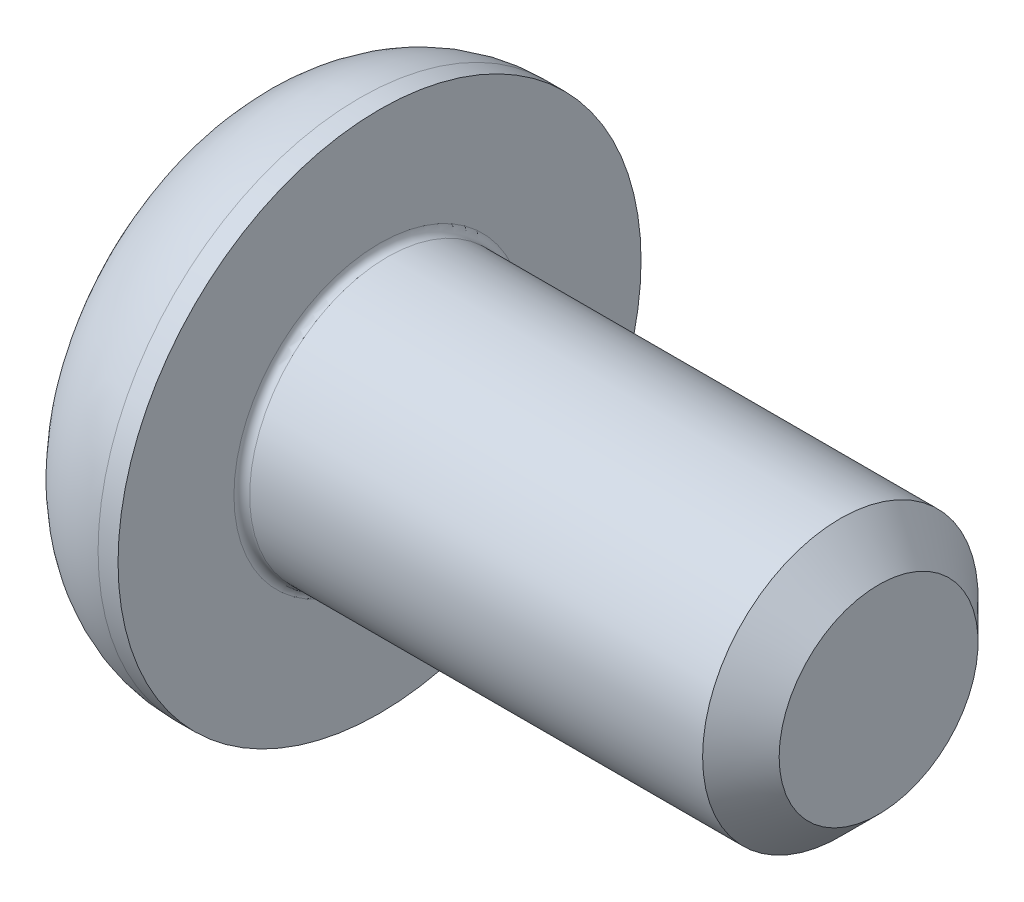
ISO-10303-21;
HEADER;
FILE_DESCRIPTION(('STEP AP214'),'2;1');
FILE_NAME('part.step','',(''),(''),'','','');
FILE_SCHEMA(('AUTOMOTIVE_DESIGN { 1 0 10303 214 1 1 1 1 }'));
ENDSEC;
DATA;
#1=APPLICATION_CONTEXT('core data for automotive mechanical design processes');
#2=APPLICATION_PROTOCOL_DEFINITION('international standard','automotive_design',2000,#1);
#3=PRODUCT_CONTEXT('',#1,'mechanical');
#4=PRODUCT('Part','Part','',(#3));
#5=PRODUCT_RELATED_PRODUCT_CATEGORY('part','',(#4));
#6=PRODUCT_DEFINITION_FORMATION('','',#4);
#7=PRODUCT_DEFINITION_CONTEXT('part definition',#1,'design');
#8=PRODUCT_DEFINITION('design','',#6,#7);
#9=PRODUCT_DEFINITION_SHAPE('','',#8);
#10=(LENGTH_UNIT() NAMED_UNIT(*) SI_UNIT(.MILLI.,.METRE.));
#11=(NAMED_UNIT(*) PLANE_ANGLE_UNIT() SI_UNIT($,.RADIAN.));
#12=(NAMED_UNIT(*) SI_UNIT($,.STERADIAN.) SOLID_ANGLE_UNIT());
#13=UNCERTAINTY_MEASURE_WITH_UNIT(LENGTH_MEASURE(1.E-05),#10,'distance_accuracy_value','');
#14=(GEOMETRIC_REPRESENTATION_CONTEXT(3) GLOBAL_UNCERTAINTY_ASSIGNED_CONTEXT((#13)) GLOBAL_UNIT_ASSIGNED_CONTEXT((#10,
#11,#12)) REPRESENTATION_CONTEXT('',''));
#15=CARTESIAN_POINT('',(0.,0.,0.));
#16=DIRECTION('',(0.,0.,1.));
#17=DIRECTION('',(1.,0.,0.));
#18=AXIS2_PLACEMENT_3D('',#15,#16,#17);
#19=CARTESIAN_POINT('',(-0.740562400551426,0.,0.));
#20=DIRECTION('',(-1.,0.,0.));
#21=DIRECTION('',(0.,0.,1.));
#22=AXIS2_PLACEMENT_3D('',#19,#20,#21);
#23=CONICAL_SURFACE('',#22,1.15070943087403,1.04719754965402);
#24=CARTESIAN_POINT('',(-0.0761999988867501,-2.8421709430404E-10,0.));
#25=VERTEX_POINT('',#24);
#26=VERTEX_LOOP('',#25);
#27=FACE_BOUND('',#26,.T.);
#28=CARTESIAN_POINT('',(-0.736600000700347,0.990600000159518,0.571923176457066));
#29=CARTESIAN_POINT('',(-0.722085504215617,0.990600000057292,0.521658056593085));
#30=CARTESIAN_POINT('',(-0.708885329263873,0.990600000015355,0.470959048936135));
#31=CARTESIAN_POINT('',(-0.6858448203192,0.990599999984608,0.368683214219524));
#32=CARTESIAN_POINT('',(-0.676012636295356,0.990599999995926,0.317104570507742));
#33=CARTESIAN_POINT('',(-0.660708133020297,0.990600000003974,0.214586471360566));
#34=CARTESIAN_POINT('',(-0.655133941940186,0.990600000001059,0.163662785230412));
#35=CARTESIAN_POINT('',(-0.648480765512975,0.990599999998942,0.0615759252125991));
#36=CARTESIAN_POINT('',(-0.647396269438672,0.990599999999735,0.0104131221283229));
#37=CARTESIAN_POINT('',(-0.649658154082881,0.990600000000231,-0.0851790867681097));
#38=CARTESIAN_POINT('',(-0.652449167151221,0.990600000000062,-0.129622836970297));
#39=CARTESIAN_POINT('',(-0.661293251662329,0.990599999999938,-0.218220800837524));
#40=CARTESIAN_POINT('',(-0.66734934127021,0.990599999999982,-0.26237470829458));
#41=CARTESIAN_POINT('',(-0.682488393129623,0.990600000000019,-0.351155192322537));
#42=CARTESIAN_POINT('',(-0.691635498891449,0.990600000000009,-0.395770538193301));
#43=CARTESIAN_POINT('',(-0.712395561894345,0.990599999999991,-0.484335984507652));
#44=CARTESIAN_POINT('',(-0.724003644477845,0.990599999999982,-0.528287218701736));
#45=CARTESIAN_POINT('',(-0.736600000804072,0.9906,-0.571923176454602));
#46=B_SPLINE_CURVE_WITH_KNOTS('',3,(#28,#29,#30,#31,#32,#33,#34,#35,#36,#37,#38,#39,#40,#41,#42,
#43,#44,#45),.UNSPECIFIED.,.F.,.F.,(4,2,2,2,2,2,2,2,4),(0.,0.157018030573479,0.314413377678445,
0.467913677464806,0.621225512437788,0.754692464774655,0.888283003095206,1.02483593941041,
1.16112087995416),.UNSPECIFIED.);
#47=CARTESIAN_POINT('',(-0.736600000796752,0.990599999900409,0.571923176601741));
#48=VERTEX_POINT('',#47);
#49=CARTESIAN_POINT('',(-0.736600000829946,0.9906,-0.571923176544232));
#50=VERTEX_POINT('',#49);
#51=EDGE_CURVE('E20',#48,#50,#46,.T.);
#52=ORIENTED_EDGE('',*,*,#51,.T.);
#53=CARTESIAN_POINT('',(-0.736600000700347,0.990599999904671,-0.571923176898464));
#54=CARTESIAN_POINT('',(-0.722085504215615,0.947069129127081,-0.597055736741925));
#55=CARTESIAN_POINT('',(-0.708885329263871,0.903162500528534,-0.622405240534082));
#56=CARTESIAN_POINT('',(-0.685844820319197,0.814589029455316,-0.673543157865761));
#57=CARTESIAN_POINT('',(-0.676012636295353,0.769920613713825,-0.699332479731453));
#58=CARTESIAN_POINT('',(-0.660708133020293,0.681137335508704,-0.75059152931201));
#59=CARTESIAN_POINT('',(-0.655133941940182,0.637036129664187,-0.776053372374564));
#60=CARTESIAN_POINT('',(-0.648480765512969,0.548626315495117,-0.827096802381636));
#61=CARTESIAN_POINT('',(-0.647396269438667,0.50431802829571,-0.852678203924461));
#62=CARTESIAN_POINT('',(-0.649658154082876,0.421532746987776,-0.900474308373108));
#63=CARTESIAN_POINT('',(-0.652449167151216,0.383043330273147,-0.922696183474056));
#64=CARTESIAN_POINT('',(-0.661293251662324,0.306315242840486,-0.966995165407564));
#65=CARTESIAN_POINT('',(-0.667349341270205,0.268076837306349,-0.989072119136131));
#66=CARTESIAN_POINT('',(-0.682488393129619,0.191190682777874,-1.03346236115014));
#67=CARTESIAN_POINT('',(-0.691635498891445,0.152552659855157,-1.05577003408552));
#68=CARTESIAN_POINT('',(-0.712395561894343,0.0758527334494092,-1.10005275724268));
#69=CARTESIAN_POINT('',(-0.724003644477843,0.0377898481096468,-1.12202837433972));
#70=CARTESIAN_POINT('',(-0.736600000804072,1.77207714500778E-10,-1.14384635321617));
#71=B_SPLINE_CURVE_WITH_KNOTS('',3,(#53,#54,#55,#56,#57,#58,#59,#60,#61,#62,#63,#64,#65,#66,#67,
#68,#69,#70),.UNSPECIFIED.,.F.,.F.,(4,2,2,2,2,2,2,2,4),(0.,0.157018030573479,0.314413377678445,
0.467913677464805,0.621225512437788,0.754692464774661,0.888283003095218,1.02483593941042,
1.16112087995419),.UNSPECIFIED.);
#72=CARTESIAN_POINT('',(-0.73660000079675,0.,-1.14384635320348));
#73=VERTEX_POINT('',#72);
#74=EDGE_CURVE('E80',#50,#73,#71,.T.);
#75=ORIENTED_EDGE('',*,*,#74,.T.);
#76=CARTESIAN_POINT('',(-0.736600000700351,-2.54851220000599E-10,-1.14384635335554));
#77=CARTESIAN_POINT('',(-0.722085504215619,-0.0435308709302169,-1.11871379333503));
#78=CARTESIAN_POINT('',(-0.708885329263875,-0.0874374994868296,-1.09336428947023));
#79=CARTESIAN_POINT('',(-0.685844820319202,-0.176010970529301,-1.0422263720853));
#80=CARTESIAN_POINT('',(-0.676012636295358,-0.22067938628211,-1.01643705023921));
#81=CARTESIAN_POINT('',(-0.660708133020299,-0.30946266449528,-0.965178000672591));
#82=CARTESIAN_POINT('',(-0.655133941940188,-0.353563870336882,-0.93971615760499));
#83=CARTESIAN_POINT('',(-0.648480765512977,-0.441973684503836,-0.88867272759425));
#84=CARTESIAN_POINT('',(-0.647396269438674,-0.486281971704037,-0.863091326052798));
#85=CARTESIAN_POINT('',(-0.649658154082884,-0.569067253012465,-0.815295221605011));
#86=CARTESIAN_POINT('',(-0.652449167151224,-0.607556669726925,-0.793073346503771));
#87=CARTESIAN_POINT('',(-0.661293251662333,-0.684284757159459,-0.748774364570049));
#88=CARTESIAN_POINT('',(-0.667349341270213,-0.722523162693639,-0.726697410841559));
#89=CARTESIAN_POINT('',(-0.682488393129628,-0.799409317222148,-0.682307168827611));
#90=CARTESIAN_POINT('',(-0.691635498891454,-0.838047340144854,-0.659999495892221));
#91=CARTESIAN_POINT('',(-0.71239556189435,-0.914747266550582,-0.615716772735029));
#92=CARTESIAN_POINT('',(-0.72400364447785,-0.952810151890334,-0.593741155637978));
#93=CARTESIAN_POINT('',(-0.736600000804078,-0.99059999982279,-0.571923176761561));
#94=B_SPLINE_CURVE_WITH_KNOTS('',3,(#76,#77,#78,#79,#80,#81,#82,#83,#84,#85,#86,#87,#88,#89,#90,
#91,#92,#93),.UNSPECIFIED.,.F.,.F.,(4,2,2,2,2,2,2,2,4),(0.,0.15701803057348,0.314413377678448,
0.467913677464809,0.621225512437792,0.754692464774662,0.888283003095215,1.02483593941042,
1.16112087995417),.UNSPECIFIED.);
#95=CARTESIAN_POINT('',(-0.736600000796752,-0.990599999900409,-0.571923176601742));
#96=VERTEX_POINT('',#95);
#97=EDGE_CURVE('E105',#73,#96,#94,.T.);
#98=ORIENTED_EDGE('',*,*,#97,.T.);
#99=CARTESIAN_POINT('',(-0.736600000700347,-0.990600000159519,-0.571923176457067));
#100=CARTESIAN_POINT('',(-0.722085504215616,-0.990600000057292,-0.521658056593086));
#101=CARTESIAN_POINT('',(-0.708885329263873,-0.990600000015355,-0.470959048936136));
#102=CARTESIAN_POINT('',(-0.685844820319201,-0.990599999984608,-0.368683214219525));
#103=CARTESIAN_POINT('',(-0.676012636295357,-0.990599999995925,-0.317104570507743));
#104=CARTESIAN_POINT('',(-0.660708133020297,-0.990600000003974,-0.214586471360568));
#105=CARTESIAN_POINT('',(-0.655133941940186,-0.990600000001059,-0.163662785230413));
#106=CARTESIAN_POINT('',(-0.648480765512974,-0.990599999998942,-0.0615759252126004));
#107=CARTESIAN_POINT('',(-0.647396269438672,-0.990599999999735,-0.0104131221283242));
#108=CARTESIAN_POINT('',(-0.649658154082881,-0.990600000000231,0.0851790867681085));
#109=CARTESIAN_POINT('',(-0.652449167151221,-0.990600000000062,0.129622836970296));
#110=CARTESIAN_POINT('',(-0.661293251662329,-0.990599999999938,0.218220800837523));
#111=CARTESIAN_POINT('',(-0.66734934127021,-0.990599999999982,0.262374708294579));
#112=CARTESIAN_POINT('',(-0.682488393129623,-0.990600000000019,0.351155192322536));
#113=CARTESIAN_POINT('',(-0.691635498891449,-0.990600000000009,0.3957705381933));
#114=CARTESIAN_POINT('',(-0.712395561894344,-0.990599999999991,0.484335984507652));
#115=CARTESIAN_POINT('',(-0.724003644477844,-0.990599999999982,0.528287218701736));
#116=CARTESIAN_POINT('',(-0.736600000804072,-0.9906,0.571923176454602));
#117=B_SPLINE_CURVE_WITH_KNOTS('',3,(#99,#100,#101,#102,#103,#104,#105,#106,#107,#108,#109,#110,
#111,#112,#113,#114,#115,#116),.UNSPECIFIED.,.F.,.F.,(4,2,2,2,2,2,2,2,4),(0.,0.157018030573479,
0.314413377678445,0.467913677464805,0.621225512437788,0.754692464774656,0.888283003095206,
1.02483593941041,1.16112087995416),.UNSPECIFIED.);
#118=CARTESIAN_POINT('',(-0.736600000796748,-0.990599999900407,0.571923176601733));
#119=VERTEX_POINT('',#118);
#120=EDGE_CURVE('E129',#96,#119,#117,.T.);
#121=ORIENTED_EDGE('',*,*,#120,.T.);
#122=CARTESIAN_POINT('',(-0.736600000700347,-0.990599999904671,0.571923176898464));
#123=CARTESIAN_POINT('',(-0.722085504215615,-0.947069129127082,0.597055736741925));
#124=CARTESIAN_POINT('',(-0.708885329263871,-0.903162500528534,0.622405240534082));
#125=CARTESIAN_POINT('',(-0.685844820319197,-0.814589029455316,0.673543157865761));
#126=CARTESIAN_POINT('',(-0.676012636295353,-0.769920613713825,0.699332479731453));
#127=CARTESIAN_POINT('',(-0.660708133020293,-0.681137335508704,0.75059152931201));
#128=CARTESIAN_POINT('',(-0.655133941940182,-0.637036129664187,0.776053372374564));
#129=CARTESIAN_POINT('',(-0.648480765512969,-0.548626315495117,0.827096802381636));
#130=CARTESIAN_POINT('',(-0.647396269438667,-0.50431802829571,0.85267820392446));
#131=CARTESIAN_POINT('',(-0.649658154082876,-0.421532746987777,0.900474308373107));
#132=CARTESIAN_POINT('',(-0.652449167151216,-0.383043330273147,0.922696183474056));
#133=CARTESIAN_POINT('',(-0.661293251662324,-0.306315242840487,0.966995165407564));
#134=CARTESIAN_POINT('',(-0.667349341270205,-0.26807683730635,0.989072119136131));
#135=CARTESIAN_POINT('',(-0.682488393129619,-0.191190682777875,1.03346236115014));
#136=CARTESIAN_POINT('',(-0.691635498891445,-0.152552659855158,1.05577003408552));
#137=CARTESIAN_POINT('',(-0.712395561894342,-0.0758527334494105,1.10005275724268));
#138=CARTESIAN_POINT('',(-0.724003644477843,-0.0377898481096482,1.12202837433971));
#139=CARTESIAN_POINT('',(-0.736600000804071,-1.77209118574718E-10,1.14384635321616));
#140=B_SPLINE_CURVE_WITH_KNOTS('',3,(#122,#123,#124,#125,#126,#127,#128,#129,#130,#131,#132,
#133,#134,#135,#136,#137,#138,#139),.UNSPECIFIED.,.F.,.F.,(4,2,2,2,2,2,2,2,4),(0.,
0.157018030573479,0.314413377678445,0.467913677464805,0.621225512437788,0.754692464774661,
0.888283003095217,1.02483593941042,1.16112087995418),.UNSPECIFIED.);
#141=CARTESIAN_POINT('',(-0.73660000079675,0.,1.14384635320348));
#142=VERTEX_POINT('',#141);
#143=EDGE_CURVE('E137',#119,#142,#140,.T.);
#144=ORIENTED_EDGE('',*,*,#143,.T.);
#145=CARTESIAN_POINT('',(-0.736600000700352,2.54849545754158E-10,1.14384635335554));
#146=CARTESIAN_POINT('',(-0.72208550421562,0.0435308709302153,1.11871379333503));
#147=CARTESIAN_POINT('',(-0.708885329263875,0.0874374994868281,1.09336428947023));
#148=CARTESIAN_POINT('',(-0.685844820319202,0.1760109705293,1.0422263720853));
#149=CARTESIAN_POINT('',(-0.676012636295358,0.220679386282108,1.01643705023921));
#150=CARTESIAN_POINT('',(-0.660708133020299,0.309462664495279,0.965178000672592));
#151=CARTESIAN_POINT('',(-0.655133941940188,0.353563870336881,0.93971615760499));
#152=CARTESIAN_POINT('',(-0.648480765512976,0.441973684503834,0.88867272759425));
#153=CARTESIAN_POINT('',(-0.647396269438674,0.486281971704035,0.863091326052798));
#154=CARTESIAN_POINT('',(-0.649658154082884,0.569067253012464,0.815295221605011));
#155=CARTESIAN_POINT('',(-0.652449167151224,0.607556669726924,0.79307334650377));
#156=CARTESIAN_POINT('',(-0.661293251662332,0.684284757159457,0.748774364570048));
#157=CARTESIAN_POINT('',(-0.667349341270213,0.722523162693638,0.726697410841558));
#158=CARTESIAN_POINT('',(-0.682488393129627,0.799409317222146,0.68230716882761));
#159=CARTESIAN_POINT('',(-0.691635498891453,0.838047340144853,0.65999949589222));
#160=CARTESIAN_POINT('',(-0.712395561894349,0.91474726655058,0.615716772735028));
#161=CARTESIAN_POINT('',(-0.724003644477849,0.952810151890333,0.593741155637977));
#162=CARTESIAN_POINT('',(-0.736600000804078,0.990599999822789,0.571923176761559));
#163=B_SPLINE_CURVE_WITH_KNOTS('',3,(#145,#146,#147,#148,#149,#150,#151,#152,#153,#154,#155,
#156,#157,#158,#159,#160,#161,#162),.UNSPECIFIED.,.F.,.F.,(4,2,2,2,2,2,2,2,4),(0.,
0.15701803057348,0.314413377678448,0.467913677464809,0.621225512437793,0.754692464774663,
0.888283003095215,1.02483593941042,1.16112087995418),.UNSPECIFIED.);
#164=EDGE_CURVE('E82',#142,#48,#163,.T.);
#165=ORIENTED_EDGE('',*,*,#164,.T.);
#166=EDGE_LOOP('',(#52,#75,#98,#121,#144,#165));
#167=FACE_BOUND('',#166,.T.);
#168=ADVANCED_FACE('F16',(#27,#167),#23,.F.);
#169=CARTESIAN_POINT('',(-1.8542,0.9906,0.571923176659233));
#170=DIRECTION('',(0.,1.,0.));
#171=DIRECTION('',(0.,0.,1.));
#172=AXIS2_PLACEMENT_3D('',#169,#170,#171);
#173=PLANE('',#172);
#174=DIRECTION('',(1.,0.,0.));
#175=VECTOR('',#174,1.);
#176=CARTESIAN_POINT('',(-1.8542,0.990600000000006,0.571923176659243));
#177=LINE('',#176,#175);
#178=CARTESIAN_POINT('',(-1.8542,0.990600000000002,0.571923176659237));
#179=VERTEX_POINT('',#178);
#180=EDGE_CURVE('E84',#48,#179,#177,.F.);
#181=ORIENTED_EDGE('',*,*,#180,.T.);
#182=DIRECTION('',(0.,0.,1.));
#183=VECTOR('',#182,1.);
#184=CARTESIAN_POINT('',(-1.8542,0.9906,0.));
#185=LINE('',#184,#183);
#186=CARTESIAN_POINT('',(-1.8542,0.9906,-0.571923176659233));
#187=VERTEX_POINT('',#186);
#188=EDGE_CURVE('E89',#187,#179,#185,.T.);
#189=ORIENTED_EDGE('',*,*,#188,.F.);
#190=DIRECTION('',(1.,0.,0.));
#191=VECTOR('',#190,1.);
#192=CARTESIAN_POINT('',(-1.8542,0.9906,-0.571923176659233));
#193=LINE('',#192,#191);
#194=EDGE_CURVE('E87',#187,#50,#193,.T.);
#195=ORIENTED_EDGE('',*,*,#194,.T.);
#196=ORIENTED_EDGE('',*,*,#51,.F.);
#197=EDGE_LOOP('',(#181,#189,#195,#196));
#198=FACE_BOUND('',#197,.T.);
#199=ADVANCED_FACE('F76',(#198),#173,.F.);
#200=CARTESIAN_POINT('',(-1.8542,0.,1.14384635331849));
#201=DIRECTION('',(0.,0.500000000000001,0.866025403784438));
#202=DIRECTION('',(0.,-0.866025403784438,0.500000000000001));
#203=AXIS2_PLACEMENT_3D('',#200,#201,#202);
#204=PLANE('',#203);
#205=DIRECTION('',(1.,0.,0.));
#206=VECTOR('',#205,1.);
#207=CARTESIAN_POINT('',(-1.8542,0.,1.14384635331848));
#208=LINE('',#207,#206);
#209=CARTESIAN_POINT('',(-1.8542,0.,1.14384635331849));
#210=VERTEX_POINT('',#209);
#211=EDGE_CURVE('E141',#142,#210,#208,.F.);
#212=ORIENTED_EDGE('',*,*,#211,.T.);
#213=DIRECTION('',(0.,-0.866025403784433,0.50000000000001));
#214=VECTOR('',#213,1.);
#215=CARTESIAN_POINT('',(-1.8542,0.9906,0.571923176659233));
#216=LINE('',#215,#214);
#217=EDGE_CURVE('E95',#179,#210,#216,.T.);
#218=ORIENTED_EDGE('',*,*,#217,.F.);
#219=ORIENTED_EDGE('',*,*,#180,.F.);
#220=ORIENTED_EDGE('',*,*,#164,.F.);
#221=EDGE_LOOP('',(#212,#218,#219,#220));
#222=FACE_BOUND('',#221,.T.);
#223=ADVANCED_FACE('F145',(#222),#204,.F.);
#224=CARTESIAN_POINT('',(-1.8542,-0.9906,0.571923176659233));
#225=DIRECTION('',(0.,-0.5,0.866025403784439));
#226=DIRECTION('',(0.,-0.866025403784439,-0.5));
#227=AXIS2_PLACEMENT_3D('',#224,#225,#226);
#228=PLANE('',#227);
#229=DIRECTION('',(1.,0.,0.));
#230=VECTOR('',#229,1.);
#231=CARTESIAN_POINT('',(-1.8542,-0.9906,0.571923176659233));
#232=LINE('',#231,#230);
#233=CARTESIAN_POINT('',(-1.8542,-0.9906,0.571923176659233));
#234=VERTEX_POINT('',#233);
#235=EDGE_CURVE('E136',#119,#234,#232,.F.);
#236=ORIENTED_EDGE('',*,*,#235,.T.);
#237=DIRECTION('',(0.,-0.866025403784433,-0.50000000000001));
#238=VECTOR('',#237,1.);
#239=CARTESIAN_POINT('',(-1.8542,0.,1.14384635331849));
#240=LINE('',#239,#238);
#241=EDGE_CURVE('E264',#210,#234,#240,.T.);
#242=ORIENTED_EDGE('',*,*,#241,.F.);
#243=ORIENTED_EDGE('',*,*,#211,.F.);
#244=ORIENTED_EDGE('',*,*,#143,.F.);
#245=EDGE_LOOP('',(#236,#242,#243,#244));
#246=FACE_BOUND('',#245,.T.);
#247=ADVANCED_FACE('F125',(#246),#228,.F.);
#248=CARTESIAN_POINT('',(-1.8542,-0.9906,-0.571923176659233));
#249=DIRECTION('',(0.,-1.,0.));
#250=DIRECTION('',(0.,0.,-1.));
#251=AXIS2_PLACEMENT_3D('',#248,#249,#250);
#252=PLANE('',#251);
#253=DIRECTION('',(1.,0.,0.));
#254=VECTOR('',#253,1.);
#255=CARTESIAN_POINT('',(-1.8542,-0.990600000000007,-0.571923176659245));
#256=LINE('',#255,#254);
#257=CARTESIAN_POINT('',(-1.8542,-0.990600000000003,-0.571923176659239));
#258=VERTEX_POINT('',#257);
#259=EDGE_CURVE('E135',#96,#258,#256,.F.);
#260=ORIENTED_EDGE('',*,*,#259,.T.);
#261=DIRECTION('',(0.,0.,1.));
#262=VECTOR('',#261,1.);
#263=CARTESIAN_POINT('',(-1.8542,-0.9906,0.));
#264=LINE('',#263,#262);
#265=EDGE_CURVE('E259',#234,#258,#264,.F.);
#266=ORIENTED_EDGE('',*,*,#265,.F.);
#267=ORIENTED_EDGE('',*,*,#235,.F.);
#268=ORIENTED_EDGE('',*,*,#120,.F.);
#269=EDGE_LOOP('',(#260,#266,#267,#268));
#270=FACE_BOUND('',#269,.T.);
#271=ADVANCED_FACE('F121',(#270),#252,.F.);
#272=CARTESIAN_POINT('',(-1.8542,0.,-1.14384635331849));
#273=DIRECTION('',(0.,-0.5,-0.866025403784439));
#274=DIRECTION('',(0.,0.866025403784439,-0.5));
#275=AXIS2_PLACEMENT_3D('',#272,#273,#274);
#276=PLANE('',#275);
#277=DIRECTION('',(1.,0.,0.));
#278=VECTOR('',#277,1.);
#279=CARTESIAN_POINT('',(-1.8542,0.,-1.14384635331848));
#280=LINE('',#279,#278);
#281=CARTESIAN_POINT('',(-1.8542,0.,-1.14384635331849));
#282=VERTEX_POINT('',#281);
#283=EDGE_CURVE('E38',#73,#282,#280,.F.);
#284=ORIENTED_EDGE('',*,*,#283,.T.);
#285=DIRECTION('',(0.,0.866025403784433,-0.50000000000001));
#286=VECTOR('',#285,1.);
#287=CARTESIAN_POINT('',(-1.8542,-0.9906,-0.571923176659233));
#288=LINE('',#287,#286);
#289=EDGE_CURVE('E254',#258,#282,#288,.T.);
#290=ORIENTED_EDGE('',*,*,#289,.F.);
#291=ORIENTED_EDGE('',*,*,#259,.F.);
#292=ORIENTED_EDGE('',*,*,#97,.F.);
#293=EDGE_LOOP('',(#284,#290,#291,#292));
#294=FACE_BOUND('',#293,.T.);
#295=ADVANCED_FACE('F115',(#294),#276,.F.);
#296=CARTESIAN_POINT('',(-1.8542,0.9906,-0.571923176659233));
#297=DIRECTION('',(0.,0.5,-0.866025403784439));
#298=DIRECTION('',(0.,0.866025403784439,0.5));
#299=AXIS2_PLACEMENT_3D('',#296,#297,#298);
#300=PLANE('',#299);
#301=ORIENTED_EDGE('',*,*,#194,.F.);
#302=DIRECTION('',(0.,0.866025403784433,0.50000000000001));
#303=VECTOR('',#302,1.);
#304=CARTESIAN_POINT('',(-1.8542,0.,-1.14384635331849));
#305=LINE('',#304,#303);
#306=EDGE_CURVE('E252',#282,#187,#305,.T.);
#307=ORIENTED_EDGE('',*,*,#306,.F.);
#308=ORIENTED_EDGE('',*,*,#283,.F.);
#309=ORIENTED_EDGE('',*,*,#74,.F.);
#310=EDGE_LOOP('',(#301,#307,#308,#309));
#311=FACE_BOUND('',#310,.T.);
#312=ADVANCED_FACE('F93',(#311),#300,.F.);
#313=CARTESIAN_POINT('',(-1.8542,2.23562317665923,0.));
#314=DIRECTION('',(-1.,0.,0.));
#315=DIRECTION('',(0.,0.,1.));
#316=AXIS2_PLACEMENT_3D('',#313,#314,#315);
#317=PLANE('',#316);
#318=ORIENTED_EDGE('',*,*,#289,.T.);
#319=ORIENTED_EDGE('',*,*,#306,.T.);
#320=ORIENTED_EDGE('',*,*,#188,.T.);
#321=ORIENTED_EDGE('',*,*,#217,.T.);
#322=ORIENTED_EDGE('',*,*,#241,.T.);
#323=ORIENTED_EDGE('',*,*,#265,.T.);
#324=EDGE_LOOP('',(#318,#319,#320,#321,#322,#323));
#325=FACE_BOUND('',#324,.T.);
#326=CARTESIAN_POINT('',(-1.8542,0.,0.));
#327=DIRECTION('',(1.,0.,0.));
#328=DIRECTION('',(0.,1.,0.));
#329=AXIS2_PLACEMENT_3D('',#326,#327,#328);
#330=CIRCLE('',#329,1.7272);
#331=CARTESIAN_POINT('',(-1.8542,1.7272,0.));
#332=VERTEX_POINT('',#331);
#333=EDGE_CURVE('E215',#332,#332,#330,.T.);
#334=ORIENTED_EDGE('',*,*,#333,.F.);
#335=EDGE_LOOP('',(#334));
#336=FACE_BOUND('',#335,.T.);
#337=ADVANCED_FACE('F114',(#325,#336),#317,.T.);
#338=CARTESIAN_POINT('',(-0.254,0.,0.));
#339=DIRECTION('',(1.,0.,0.));
#340=DIRECTION('',(0.,0.,-1.));
#341=AXIS2_PLACEMENT_3D('',#338,#339,#340);
#342=TOROIDAL_SURFACE('',#341,1.7272,1.6002);
#343=CARTESIAN_POINT('',(-0.254,0.,0.));
#344=DIRECTION('',(1.,0.,0.));
#345=DIRECTION('',(0.,1.,0.));
#346=AXIS2_PLACEMENT_3D('',#343,#344,#345);
#347=CIRCLE('',#346,3.3274);
#348=CARTESIAN_POINT('',(-0.254,3.3274,0.));
#349=VERTEX_POINT('',#348);
#350=EDGE_CURVE('E279',#349,#349,#347,.T.);
#351=ORIENTED_EDGE('',*,*,#350,.F.);
#352=EDGE_LOOP('',(#351));
#353=FACE_BOUND('',#352,.T.);
#354=ORIENTED_EDGE('',*,*,#333,.T.);
#355=EDGE_LOOP('',(#354));
#356=FACE_BOUND('',#355,.T.);
#357=ADVANCED_FACE('F199',(#353,#356),#342,.T.);
#358=CARTESIAN_POINT('',(-0.9271,0.,0.));
#359=DIRECTION('',(1.,0.,0.));
#360=DIRECTION('',(0.,1.,0.));
#361=AXIS2_PLACEMENT_3D('',#358,#359,#360);
#362=CYLINDRICAL_SURFACE('',#361,3.3274);
#363=ORIENTED_EDGE('',*,*,#350,.T.);
#364=EDGE_LOOP('',(#363));
#365=FACE_BOUND('',#364,.T.);
#366=CARTESIAN_POINT('',(0.,0.,0.));
#367=DIRECTION('',(1.,0.,0.));
#368=DIRECTION('',(0.,1.,0.));
#369=AXIS2_PLACEMENT_3D('',#366,#367,#368);
#370=CIRCLE('',#369,3.3274);
#371=CARTESIAN_POINT('',(0.,3.3274,0.));
#372=VERTEX_POINT('',#371);
#373=EDGE_CURVE('E103',#372,#372,#370,.T.);
#374=ORIENTED_EDGE('',*,*,#373,.F.);
#375=EDGE_LOOP('',(#374));
#376=FACE_BOUND('',#375,.T.);
#377=ADVANCED_FACE('F196',(#365,#376),#362,.T.);
#378=CARTESIAN_POINT('',(6.35,0.8763,0.));
#379=DIRECTION('',(1.,0.,0.));
#380=DIRECTION('',(0.,0.,-1.));
#381=AXIS2_PLACEMENT_3D('',#378,#379,#380);
#382=PLANE('',#381);
#383=CARTESIAN_POINT('',(6.35000000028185,0.,0.));
#384=DIRECTION('',(-1.,0.,0.));
#385=DIRECTION('',(0.,0.,1.));
#386=AXIS2_PLACEMENT_3D('',#383,#384,#385);
#387=CIRCLE('',#386,1.26568200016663);
#388=CARTESIAN_POINT('',(6.35000000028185,0.,1.26568200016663));
#389=VERTEX_POINT('',#388);
#390=EDGE_CURVE('E274',#389,#389,#387,.T.);
#391=ORIENTED_EDGE('',*,*,#390,.F.);
#392=EDGE_LOOP('',(#391));
#393=FACE_BOUND('',#392,.T.);
#394=ADVANCED_FACE('F193',(#393),#382,.T.);
#395=CARTESIAN_POINT('',(0.,2.54,0.));
#396=DIRECTION('',(1.,0.,0.));
#397=DIRECTION('',(0.,0.,-1.));
#398=AXIS2_PLACEMENT_3D('',#395,#396,#397);
#399=PLANE('',#398);
#400=CARTESIAN_POINT('',(0.,0.,0.));
#401=DIRECTION('',(1.,0.,0.));
#402=DIRECTION('',(0.,1.,0.));
#403=AXIS2_PLACEMENT_3D('',#400,#401,#402);
#404=CIRCLE('',#403,1.85260000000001);
#405=CARTESIAN_POINT('',(0.,1.85260000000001,0.));
#406=VERTEX_POINT('',#405);
#407=EDGE_CURVE('E180',#406,#406,#404,.F.);
#408=ORIENTED_EDGE('',*,*,#407,.T.);
#409=EDGE_LOOP('',(#408));
#410=FACE_BOUND('',#409,.T.);
#411=ORIENTED_EDGE('',*,*,#373,.T.);
#412=EDGE_LOOP('',(#411));
#413=FACE_BOUND('',#412,.T.);
#414=ADVANCED_FACE('F184',(#410,#413),#399,.T.);
#415=CARTESIAN_POINT('',(5.86308199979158,0.,0.));
#416=DIRECTION('',(-1.,0.,0.));
#417=DIRECTION('',(0.,0.,1.));
#418=AXIS2_PLACEMENT_3D('',#415,#416,#417);
#419=CONICAL_SURFACE('',#418,1.75259999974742,0.785398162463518);
#420=ORIENTED_EDGE('',*,*,#390,.T.);
#421=EDGE_LOOP('',(#420));
#422=FACE_BOUND('',#421,.T.);
#423=CARTESIAN_POINT('',(5.863082,0.,0.));
#424=DIRECTION('',(1.,0.,0.));
#425=DIRECTION('',(0.,1.,0.));
#426=AXIS2_PLACEMENT_3D('',#423,#424,#425);
#427=CIRCLE('',#426,1.7526);
#428=CARTESIAN_POINT('',(5.863082,1.7526,0.));
#429=VERTEX_POINT('',#428);
#430=EDGE_CURVE('E29',#429,#429,#427,.F.);
#431=ORIENTED_EDGE('',*,*,#430,.F.);
#432=EDGE_LOOP('',(#431));
#433=FACE_BOUND('',#432,.T.);
#434=ADVANCED_FACE('F162',(#422,#433),#419,.T.);
#435=CARTESIAN_POINT('',(0.100000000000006,0.,0.));
#436=DIRECTION('',(1.,0.,0.));
#437=DIRECTION('',(0.,0.,-1.));
#438=AXIS2_PLACEMENT_3D('',#435,#436,#437);
#439=TOROIDAL_SURFACE('',#438,1.85260000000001,0.100000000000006);
#440=CARTESIAN_POINT('',(0.100000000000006,0.,0.));
#441=DIRECTION('',(1.,0.,0.));
#442=DIRECTION('',(0.,1.,0.));
#443=AXIS2_PLACEMENT_3D('',#440,#441,#442);
#444=CIRCLE('',#443,1.7526);
#445=CARTESIAN_POINT('',(0.100000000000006,1.7526,0.));
#446=VERTEX_POINT('',#445);
#447=EDGE_CURVE('E11',#446,#446,#444,.T.);
#448=ORIENTED_EDGE('',*,*,#447,.F.);
#449=EDGE_LOOP('',(#448));
#450=FACE_BOUND('',#449,.T.);
#451=ORIENTED_EDGE('',*,*,#407,.F.);
#452=EDGE_LOOP('',(#451));
#453=FACE_BOUND('',#452,.T.);
#454=ADVANCED_FACE('F156',(#450,#453),#439,.F.);
#455=CARTESIAN_POINT('',(3.9701199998,0.,0.));
#456=DIRECTION('',(1.,0.,0.));
#457=DIRECTION('',(0.,1.,0.));
#458=AXIS2_PLACEMENT_3D('',#455,#456,#457);
#459=CYLINDRICAL_SURFACE('',#458,1.7526);
#460=ORIENTED_EDGE('',*,*,#447,.T.);
#461=EDGE_LOOP('',(#460));
#462=FACE_BOUND('',#461,.T.);
#463=ORIENTED_EDGE('',*,*,#430,.T.);
#464=EDGE_LOOP('',(#463));
#465=FACE_BOUND('',#464,.T.);
#466=ADVANCED_FACE('F154',(#462,#465),#459,.T.);
#467=CLOSED_SHELL('',(#168,#199,#223,#247,#271,#295,#312,#337,#357,#377,#394,#414,#434,#454,#466));
#468=MANIFOLD_SOLID_BREP('B1',#467);
#469=ADVANCED_BREP_SHAPE_REPRESENTATION('',(#18,#468),#14);
#470=SHAPE_DEFINITION_REPRESENTATION(#9,#469);
ENDSEC;
END-ISO-10303-21;
